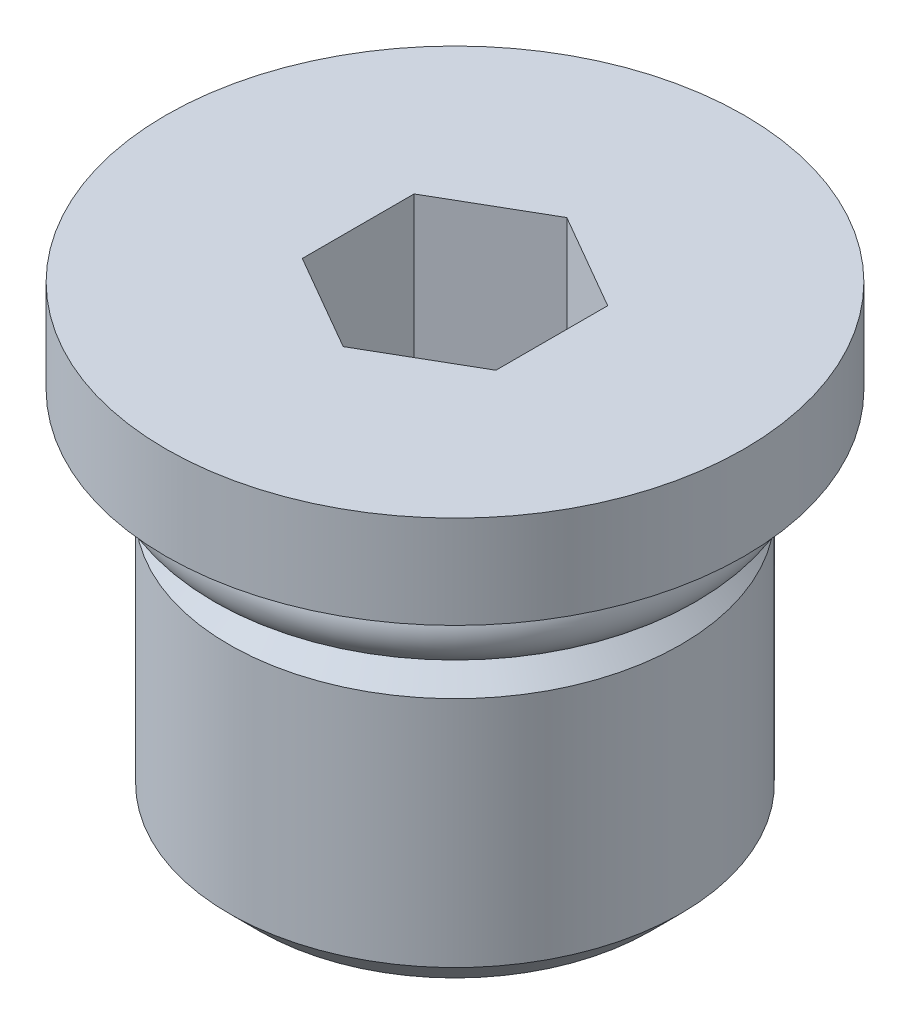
from build123d import *

# Parameters (mm, degrees)
CUT_EXTRUDE1_DEPTH = 4.7625
SKETCH3_R          = 0.9017


with BuildPart() as part:
    # Sketch1 → Revolve1 (revolve)
    with BuildSketch(Plane.XY):
        Polygon((4.8006, -1.905), (5.55625, -2.66065), (5.55625, -8.38835), (4.8006, -9.144), (0, -9.144), (0, 2.286), (7.112, 2.286), (7.112, 0), (4.8006, 0), align=None)
    revolve(axis=Axis((0, 0, 0), (0, 1, 0)))

    # Sketch2 → Cut-Extrude1 (cut)
    with BuildSketch(Plane(origin=(0, 2.286, 0), x_dir=(-1, 0, 0), z_dir=(0, 1, 0))):
        Polygon((0, -2.749630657), (2.38125, -1.374815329), (2.38125, 1.374815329), (0, 2.749630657), (-2.38125, 1.374815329), (-2.38125, -1.374815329), align=None)
    extrude(amount=-CUT_EXTRUDE1_DEPTH, mode=Mode.SUBTRACT)

    # Sketch3 → Revolve3 (revolve)
    with BuildSketch(Plane.XY):
        with Locations((5.2832, -0.9271)):
            Circle(SKETCH3_R)
    revolve(axis=Axis((0, 0, 0), (0, -1, 0)))


solid = part.part
